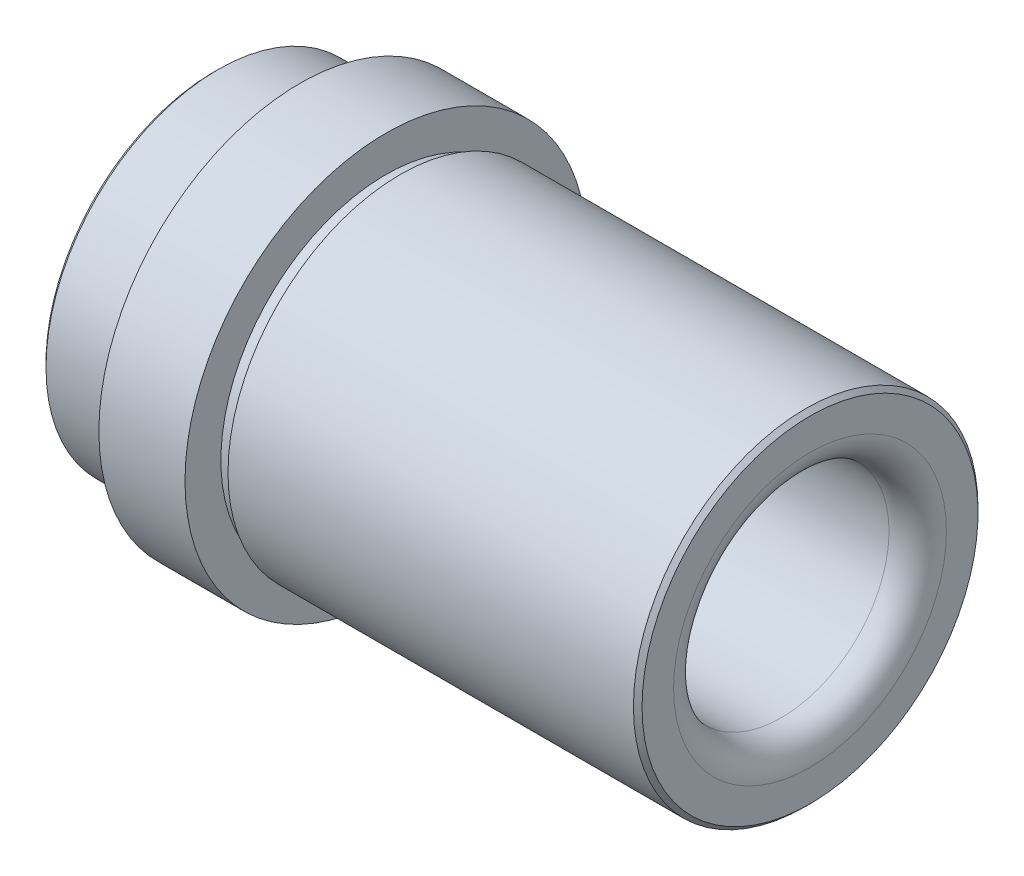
ISO-10303-21;
HEADER;
FILE_DESCRIPTION(('STEP AP214'),'2;1');
FILE_NAME('part.step','',(''),(''),'','','');
FILE_SCHEMA(('AUTOMOTIVE_DESIGN { 1 0 10303 214 1 1 1 1 }'));
ENDSEC;
DATA;
#1=APPLICATION_CONTEXT('core data for automotive mechanical design processes');
#2=APPLICATION_PROTOCOL_DEFINITION('international standard','automotive_design',2000,#1);
#3=PRODUCT_CONTEXT('',#1,'mechanical');
#4=PRODUCT('Part','Part','',(#3));
#5=PRODUCT_RELATED_PRODUCT_CATEGORY('part','',(#4));
#6=PRODUCT_DEFINITION_FORMATION('','',#4);
#7=PRODUCT_DEFINITION_CONTEXT('part definition',#1,'design');
#8=PRODUCT_DEFINITION('design','',#6,#7);
#9=PRODUCT_DEFINITION_SHAPE('','',#8);
#10=(LENGTH_UNIT() NAMED_UNIT(*) SI_UNIT(.MILLI.,.METRE.));
#11=(NAMED_UNIT(*) PLANE_ANGLE_UNIT() SI_UNIT($,.RADIAN.));
#12=(NAMED_UNIT(*) SI_UNIT($,.STERADIAN.) SOLID_ANGLE_UNIT());
#13=UNCERTAINTY_MEASURE_WITH_UNIT(LENGTH_MEASURE(1.E-05),#10,'distance_accuracy_value','');
#14=(GEOMETRIC_REPRESENTATION_CONTEXT(3) GLOBAL_UNCERTAINTY_ASSIGNED_CONTEXT((#13)) GLOBAL_UNIT_ASSIGNED_CONTEXT((#10,
#11,#12)) REPRESENTATION_CONTEXT('',''));
#15=CARTESIAN_POINT('',(0.,0.,0.));
#16=DIRECTION('',(0.,0.,1.));
#17=DIRECTION('',(1.,0.,0.));
#18=AXIS2_PLACEMENT_3D('',#15,#16,#17);
#19=CARTESIAN_POINT('',(2.65,0.,0.));
#20=DIRECTION('',(1.,0.,0.));
#21=DIRECTION('',(0.,0.,-1.));
#22=AXIS2_PLACEMENT_3D('',#19,#20,#21);
#23=CYLINDRICAL_SURFACE('',#22,11.98475);
#24=CARTESIAN_POINT('',(0.300000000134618,0.,0.));
#25=DIRECTION('',(1.,0.,0.));
#26=DIRECTION('',(0.,1.,0.));
#27=AXIS2_PLACEMENT_3D('',#24,#25,#26);
#28=CIRCLE('',#27,11.9847499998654);
#29=CARTESIAN_POINT('',(0.300000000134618,11.9847499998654,0.));
#30=VERTEX_POINT('',#29);
#31=EDGE_CURVE('E63',#30,#30,#28,.F.);
#32=ORIENTED_EDGE('',*,*,#31,.F.);
#33=EDGE_LOOP('',(#32));
#34=FACE_BOUND('',#33,.T.);
#35=CARTESIAN_POINT('',(5.,0.,0.));
#36=DIRECTION('',(1.,0.,0.));
#37=DIRECTION('',(0.,0.,-1.));
#38=AXIS2_PLACEMENT_3D('',#35,#36,#37);
#39=CIRCLE('',#38,11.98475);
#40=CARTESIAN_POINT('',(5.,0.,-11.98475));
#41=VERTEX_POINT('',#40);
#42=EDGE_CURVE('E18',#41,#41,#39,.T.);
#43=ORIENTED_EDGE('',*,*,#42,.F.);
#44=EDGE_LOOP('',(#43));
#45=FACE_BOUND('',#44,.T.);
#46=ADVANCED_FACE('F15',(#34,#45),#23,.T.);
#47=CARTESIAN_POINT('',(0.300000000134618,0.,0.));
#48=DIRECTION('',(1.,0.,0.));
#49=DIRECTION('',(0.,0.,-1.));
#50=AXIS2_PLACEMENT_3D('',#47,#48,#49);
#51=CONICAL_SURFACE('',#50,11.9847499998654,0.785398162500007);
#52=CARTESIAN_POINT('',(-1.3461535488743E-10,0.,0.));
#53=DIRECTION('',(1.,0.,0.));
#54=DIRECTION('',(0.,0.,-1.));
#55=AXIS2_PLACEMENT_3D('',#52,#53,#54);
#56=CIRCLE('',#55,11.6847500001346);
#57=CARTESIAN_POINT('',(-1.3461535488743E-10,0.,-11.6847500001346));
#58=VERTEX_POINT('',#57);
#59=EDGE_CURVE('E58',#58,#58,#56,.F.);
#60=ORIENTED_EDGE('',*,*,#59,.F.);
#61=EDGE_LOOP('',(#60));
#62=FACE_BOUND('',#61,.T.);
#63=ORIENTED_EDGE('',*,*,#31,.T.);
#64=EDGE_LOOP('',(#63));
#65=FACE_BOUND('',#64,.T.);
#66=ADVANCED_FACE('F131',(#62,#65),#51,.T.);
#67=CARTESIAN_POINT('',(5.,11.742375,0.));
#68=DIRECTION('',(1.,0.,0.));
#69=DIRECTION('',(0.,0.,-1.));
#70=AXIS2_PLACEMENT_3D('',#67,#68,#69);
#71=PLANE('',#70);
#72=CARTESIAN_POINT('',(5.,0.,0.));
#73=DIRECTION('',(1.,0.,0.));
#74=DIRECTION('',(0.,0.,-1.));
#75=AXIS2_PLACEMENT_3D('',#72,#73,#74);
#76=CIRCLE('',#75,11.5);
#77=CARTESIAN_POINT('',(5.,0.,-11.5));
#78=VERTEX_POINT('',#77);
#79=EDGE_CURVE('E56',#78,#78,#76,.T.);
#80=ORIENTED_EDGE('',*,*,#79,.F.);
#81=EDGE_LOOP('',(#80));
#82=FACE_BOUND('',#81,.T.);
#83=ORIENTED_EDGE('',*,*,#42,.T.);
#84=EDGE_LOOP('',(#83));
#85=FACE_BOUND('',#84,.T.);
#86=ADVANCED_FACE('F122',(#82,#85),#71,.T.);
#87=CARTESIAN_POINT('',(0.,9.844625,0.));
#88=DIRECTION('',(-1.,0.,0.));
#89=DIRECTION('',(0.,0.,1.));
#90=AXIS2_PLACEMENT_3D('',#87,#88,#89);
#91=PLANE('',#90);
#92=CARTESIAN_POINT('',(-2.24362412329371E-10,0.,0.));
#93=DIRECTION('',(-1.,0.,0.));
#94=DIRECTION('',(0.,0.,1.));
#95=AXIS2_PLACEMENT_3D('',#92,#93,#94);
#96=CIRCLE('',#95,8.00449999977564);
#97=CARTESIAN_POINT('',(-2.24362412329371E-10,0.,8.00449999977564));
#98=VERTEX_POINT('',#97);
#99=EDGE_CURVE('E53',#98,#98,#96,.F.);
#100=ORIENTED_EDGE('',*,*,#99,.T.);
#101=EDGE_LOOP('',(#100));
#102=FACE_BOUND('',#101,.T.);
#103=ORIENTED_EDGE('',*,*,#59,.T.);
#104=EDGE_LOOP('',(#103));
#105=FACE_BOUND('',#104,.T.);
#106=ADVANCED_FACE('F120',(#102,#105),#91,.T.);
#107=CARTESIAN_POINT('',(5.5,0.,0.));
#108=DIRECTION('',(1.,0.,0.));
#109=DIRECTION('',(0.,0.,-1.));
#110=AXIS2_PLACEMENT_3D('',#107,#108,#109);
#111=CYLINDRICAL_SURFACE('',#110,11.5);
#112=ORIENTED_EDGE('',*,*,#79,.T.);
#113=EDGE_LOOP('',(#112));
#114=FACE_BOUND('',#113,.T.);
#115=CARTESIAN_POINT('',(6.,0.,0.));
#116=DIRECTION('',(1.,0.,0.));
#117=DIRECTION('',(0.,0.,-1.));
#118=AXIS2_PLACEMENT_3D('',#115,#116,#117);
#119=CIRCLE('',#118,11.5);
#120=CARTESIAN_POINT('',(6.,0.,-11.5));
#121=VERTEX_POINT('',#120);
#122=EDGE_CURVE('E50',#121,#121,#119,.T.);
#123=ORIENTED_EDGE('',*,*,#122,.F.);
#124=EDGE_LOOP('',(#123));
#125=FACE_BOUND('',#124,.T.);
#126=ADVANCED_FACE('F116',(#114,#125),#111,.T.);
#127=CARTESIAN_POINT('',(-2.24362466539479E-10,0.,0.));
#128=DIRECTION('',(-1.,0.,0.));
#129=DIRECTION('',(0.,0.,1.));
#130=AXIS2_PLACEMENT_3D('',#127,#128,#129);
#131=CONICAL_SURFACE('',#130,8.00449999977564,0.7853981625);
#132=CARTESIAN_POINT('',(0.5,0.,0.));
#133=DIRECTION('',(1.,0.,0.));
#134=DIRECTION('',(0.,0.,-1.));
#135=AXIS2_PLACEMENT_3D('',#132,#133,#134);
#136=CIRCLE('',#135,7.5045);
#137=CARTESIAN_POINT('',(0.5,0.,-7.5045));
#138=VERTEX_POINT('',#137);
#139=EDGE_CURVE('E49',#138,#138,#136,.T.);
#140=ORIENTED_EDGE('',*,*,#139,.T.);
#141=EDGE_LOOP('',(#140));
#142=FACE_BOUND('',#141,.T.);
#143=ORIENTED_EDGE('',*,*,#99,.F.);
#144=EDGE_LOOP('',(#143));
#145=FACE_BOUND('',#144,.T.);
#146=ADVANCED_FACE('F113',(#142,#145),#131,.F.);
#147=CARTESIAN_POINT('',(6.,12.992375,0.));
#148=DIRECTION('',(-1.,0.,0.));
#149=DIRECTION('',(0.,0.,1.));
#150=AXIS2_PLACEMENT_3D('',#147,#148,#149);
#151=PLANE('',#150);
#152=ORIENTED_EDGE('',*,*,#122,.T.);
#153=EDGE_LOOP('',(#152));
#154=FACE_BOUND('',#153,.T.);
#155=CARTESIAN_POINT('',(6.,0.,0.));
#156=DIRECTION('',(1.,0.,0.));
#157=DIRECTION('',(0.,0.,-1.));
#158=AXIS2_PLACEMENT_3D('',#155,#156,#157);
#159=CIRCLE('',#158,14.);
#160=CARTESIAN_POINT('',(6.,0.,-14.));
#161=VERTEX_POINT('',#160);
#162=EDGE_CURVE('E46',#161,#161,#159,.T.);
#163=ORIENTED_EDGE('',*,*,#162,.F.);
#164=EDGE_LOOP('',(#163));
#165=FACE_BOUND('',#164,.T.);
#166=ADVANCED_FACE('F110',(#154,#165),#151,.T.);
#167=CARTESIAN_POINT('',(20.025,0.,0.));
#168=DIRECTION('',(1.,0.,0.));
#169=DIRECTION('',(0.,0.,-1.));
#170=AXIS2_PLACEMENT_3D('',#167,#168,#169);
#171=CYLINDRICAL_SURFACE('',#170,7.5045);
#172=CARTESIAN_POINT('',(39.55,0.,0.));
#173=DIRECTION('',(1.,0.,0.));
#174=DIRECTION('',(0.,0.,-1.));
#175=AXIS2_PLACEMENT_3D('',#172,#173,#174);
#176=CIRCLE('',#175,7.50449999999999);
#177=CARTESIAN_POINT('',(39.55,0.,-7.50449999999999));
#178=VERTEX_POINT('',#177);
#179=EDGE_CURVE('E45',#178,#178,#176,.F.);
#180=ORIENTED_EDGE('',*,*,#179,.F.);
#181=EDGE_LOOP('',(#180));
#182=FACE_BOUND('',#181,.T.);
#183=ORIENTED_EDGE('',*,*,#139,.F.);
#184=EDGE_LOOP('',(#183));
#185=FACE_BOUND('',#184,.T.);
#186=ADVANCED_FACE('F107',(#182,#185),#171,.F.);
#187=CARTESIAN_POINT('',(9.,0.,0.));
#188=DIRECTION('',(1.,0.,0.));
#189=DIRECTION('',(0.,0.,-1.));
#190=AXIS2_PLACEMENT_3D('',#187,#188,#189);
#191=CYLINDRICAL_SURFACE('',#190,14.);
#192=ORIENTED_EDGE('',*,*,#162,.T.);
#193=EDGE_LOOP('',(#192));
#194=FACE_BOUND('',#193,.T.);
#195=CARTESIAN_POINT('',(12.,0.,0.));
#196=DIRECTION('',(1.,0.,0.));
#197=DIRECTION('',(0.,0.,-1.));
#198=AXIS2_PLACEMENT_3D('',#195,#196,#197);
#199=CIRCLE('',#198,14.);
#200=CARTESIAN_POINT('',(12.,0.,-14.));
#201=VERTEX_POINT('',#200);
#202=EDGE_CURVE('E42',#201,#201,#199,.T.);
#203=ORIENTED_EDGE('',*,*,#202,.F.);
#204=EDGE_LOOP('',(#203));
#205=FACE_BOUND('',#204,.T.);
#206=ADVANCED_FACE('F92',(#194,#205),#191,.T.);
#207=CARTESIAN_POINT('',(39.55,0.,0.));
#208=DIRECTION('',(1.,0.,0.));
#209=DIRECTION('',(0.,0.,-1.));
#210=AXIS2_PLACEMENT_3D('',#207,#208,#209);
#211=TOROIDAL_SURFACE('',#210,9.5045,2.00000000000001);
#212=CARTESIAN_POINT('',(41.55,0.,0.));
#213=DIRECTION('',(1.,0.,0.));
#214=DIRECTION('',(0.,1.,0.));
#215=AXIS2_PLACEMENT_3D('',#212,#213,#214);
#216=CIRCLE('',#215,9.5045);
#217=CARTESIAN_POINT('',(41.55,9.5045,0.));
#218=VERTEX_POINT('',#217);
#219=EDGE_CURVE('E41',#218,#218,#216,.F.);
#220=ORIENTED_EDGE('',*,*,#219,.F.);
#221=EDGE_LOOP('',(#220));
#222=FACE_BOUND('',#221,.T.);
#223=ORIENTED_EDGE('',*,*,#179,.T.);
#224=EDGE_LOOP('',(#223));
#225=FACE_BOUND('',#224,.T.);
#226=ADVANCED_FACE('F80',(#222,#225),#211,.T.);
#227=CARTESIAN_POINT('',(12.,12.75,0.));
#228=DIRECTION('',(1.,0.,0.));
#229=DIRECTION('',(0.,0.,-1.));
#230=AXIS2_PLACEMENT_3D('',#227,#228,#229);
#231=PLANE('',#230);
#232=CARTESIAN_POINT('',(12.,0.,0.));
#233=DIRECTION('',(1.,0.,0.));
#234=DIRECTION('',(0.,0.,-1.));
#235=AXIS2_PLACEMENT_3D('',#232,#233,#234);
#236=CIRCLE('',#235,11.5);
#237=CARTESIAN_POINT('',(12.,0.,-11.5));
#238=VERTEX_POINT('',#237);
#239=EDGE_CURVE('E38',#238,#238,#236,.T.);
#240=ORIENTED_EDGE('',*,*,#239,.F.);
#241=EDGE_LOOP('',(#240));
#242=FACE_BOUND('',#241,.T.);
#243=ORIENTED_EDGE('',*,*,#202,.T.);
#244=EDGE_LOOP('',(#243));
#245=FACE_BOUND('',#244,.T.);
#246=ADVANCED_FACE('F91',(#242,#245),#231,.T.);
#247=CARTESIAN_POINT('',(41.55,10.604375,0.));
#248=DIRECTION('',(1.,0.,0.));
#249=DIRECTION('',(0.,0.,-1.));
#250=AXIS2_PLACEMENT_3D('',#247,#248,#249);
#251=PLANE('',#250);
#252=ORIENTED_EDGE('',*,*,#219,.T.);
#253=EDGE_LOOP('',(#252));
#254=FACE_BOUND('',#253,.T.);
#255=CARTESIAN_POINT('',(41.5500000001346,0.,0.));
#256=DIRECTION('',(-1.,0.,0.));
#257=DIRECTION('',(0.,0.,1.));
#258=AXIS2_PLACEMENT_3D('',#255,#256,#257);
#259=CIRCLE('',#258,11.7042500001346);
#260=CARTESIAN_POINT('',(41.5500000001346,0.,11.7042500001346));
#261=VERTEX_POINT('',#260);
#262=EDGE_CURVE('E35',#261,#261,#259,.T.);
#263=ORIENTED_EDGE('',*,*,#262,.F.);
#264=EDGE_LOOP('',(#263));
#265=FACE_BOUND('',#264,.T.);
#266=ADVANCED_FACE('F151',(#254,#265),#251,.T.);
#267=CARTESIAN_POINT('',(12.5,0.,0.));
#268=DIRECTION('',(1.,0.,0.));
#269=DIRECTION('',(0.,0.,-1.));
#270=AXIS2_PLACEMENT_3D('',#267,#268,#269);
#271=CYLINDRICAL_SURFACE('',#270,11.5);
#272=ORIENTED_EDGE('',*,*,#239,.T.);
#273=EDGE_LOOP('',(#272));
#274=FACE_BOUND('',#273,.T.);
#275=CARTESIAN_POINT('',(13.,0.,0.));
#276=DIRECTION('',(1.,0.,0.));
#277=DIRECTION('',(0.,0.,-1.));
#278=AXIS2_PLACEMENT_3D('',#275,#276,#277);
#279=CIRCLE('',#278,11.5);
#280=CARTESIAN_POINT('',(13.,0.,-11.5));
#281=VERTEX_POINT('',#280);
#282=EDGE_CURVE('E27',#281,#281,#279,.T.);
#283=ORIENTED_EDGE('',*,*,#282,.F.);
#284=EDGE_LOOP('',(#283));
#285=FACE_BOUND('',#284,.T.);
#286=ADVANCED_FACE('F148',(#274,#285),#271,.T.);
#287=CARTESIAN_POINT('',(41.2499999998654,0.,0.));
#288=DIRECTION('',(-1.,0.,0.));
#289=DIRECTION('',(0.,0.,1.));
#290=AXIS2_PLACEMENT_3D('',#287,#288,#289);
#291=CONICAL_SURFACE('',#290,12.0042499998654,0.785398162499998);
#292=CARTESIAN_POINT('',(41.25,0.,0.));
#293=DIRECTION('',(1.,0.,0.));
#294=DIRECTION('',(0.,0.,-1.));
#295=AXIS2_PLACEMENT_3D('',#292,#293,#294);
#296=CIRCLE('',#295,12.00425);
#297=CARTESIAN_POINT('',(41.25,0.,-12.00425));
#298=VERTEX_POINT('',#297);
#299=EDGE_CURVE('E22',#298,#298,#296,.F.);
#300=ORIENTED_EDGE('',*,*,#299,.F.);
#301=EDGE_LOOP('',(#300));
#302=FACE_BOUND('',#301,.T.);
#303=ORIENTED_EDGE('',*,*,#262,.T.);
#304=EDGE_LOOP('',(#303));
#305=FACE_BOUND('',#304,.T.);
#306=ADVANCED_FACE('F141',(#302,#305),#291,.T.);
#307=CARTESIAN_POINT('',(13.,11.752125,0.));
#308=DIRECTION('',(-1.,0.,0.));
#309=DIRECTION('',(0.,0.,1.));
#310=AXIS2_PLACEMENT_3D('',#307,#308,#309);
#311=PLANE('',#310);
#312=ORIENTED_EDGE('',*,*,#282,.T.);
#313=EDGE_LOOP('',(#312));
#314=FACE_BOUND('',#313,.T.);
#315=CARTESIAN_POINT('',(13.,0.,0.));
#316=DIRECTION('',(1.,0.,0.));
#317=DIRECTION('',(0.,0.,-1.));
#318=AXIS2_PLACEMENT_3D('',#315,#316,#317);
#319=CIRCLE('',#318,12.00425);
#320=CARTESIAN_POINT('',(13.,0.,-12.00425));
#321=VERTEX_POINT('',#320);
#322=EDGE_CURVE('E10',#321,#321,#319,.T.);
#323=ORIENTED_EDGE('',*,*,#322,.F.);
#324=EDGE_LOOP('',(#323));
#325=FACE_BOUND('',#324,.T.);
#326=ADVANCED_FACE('F136',(#314,#325),#311,.T.);
#327=CARTESIAN_POINT('',(27.125,0.,0.));
#328=DIRECTION('',(1.,0.,0.));
#329=DIRECTION('',(0.,0.,-1.));
#330=AXIS2_PLACEMENT_3D('',#327,#328,#329);
#331=CYLINDRICAL_SURFACE('',#330,12.00425);
#332=ORIENTED_EDGE('',*,*,#322,.T.);
#333=EDGE_LOOP('',(#332));
#334=FACE_BOUND('',#333,.T.);
#335=ORIENTED_EDGE('',*,*,#299,.T.);
#336=EDGE_LOOP('',(#335));
#337=FACE_BOUND('',#336,.T.);
#338=ADVANCED_FACE('F134',(#334,#337),#331,.T.);
#339=CLOSED_SHELL('',(#46,#66,#86,#106,#126,#146,#166,#186,#206,#226,#246,#266,#286,#306,#326,#338));
#340=MANIFOLD_SOLID_BREP('B1',#339);
#341=ADVANCED_BREP_SHAPE_REPRESENTATION('',(#18,#340),#14);
#342=SHAPE_DEFINITION_REPRESENTATION(#9,#341);
ENDSEC;
END-ISO-10303-21;
